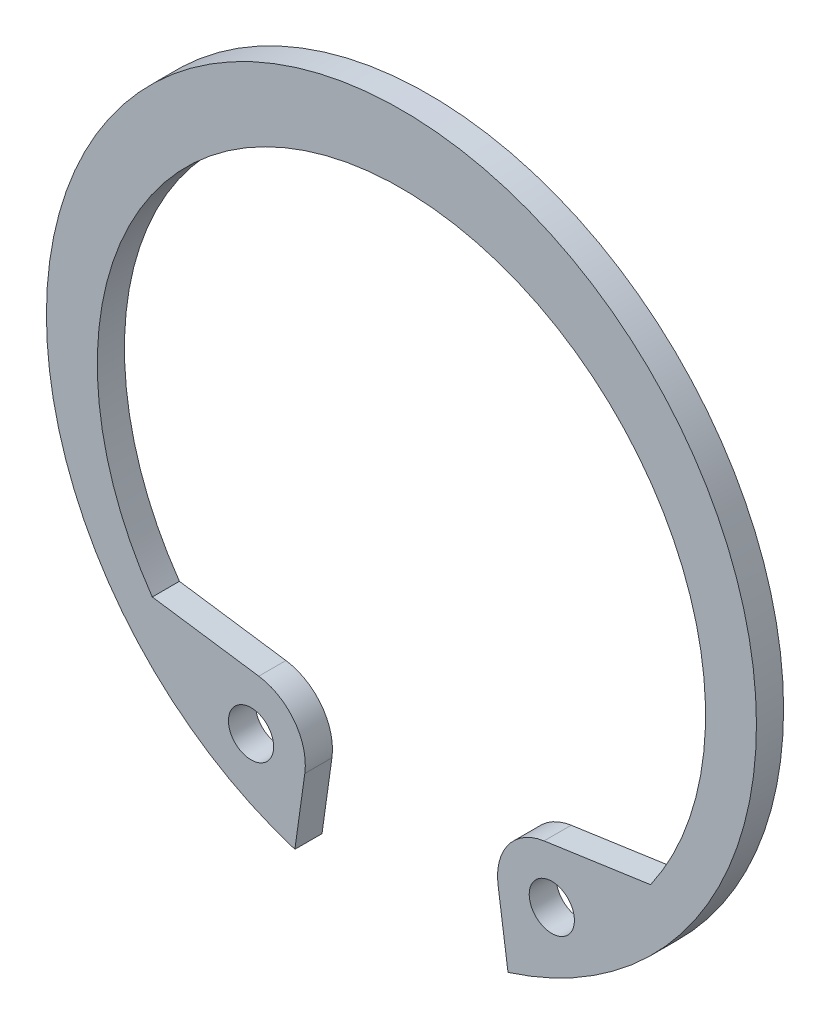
ISO-10303-21;
HEADER;
FILE_DESCRIPTION(('STEP AP214'),'2;1');
FILE_NAME('part.step','',(''),(''),'','','');
FILE_SCHEMA(('AUTOMOTIVE_DESIGN { 1 0 10303 214 1 1 1 1 }'));
ENDSEC;
DATA;
#1=APPLICATION_CONTEXT('core data for automotive mechanical design processes');
#2=APPLICATION_PROTOCOL_DEFINITION('international standard','automotive_design',2000,#1);
#3=PRODUCT_CONTEXT('',#1,'mechanical');
#4=PRODUCT('Part','Part','',(#3));
#5=PRODUCT_RELATED_PRODUCT_CATEGORY('part','',(#4));
#6=PRODUCT_DEFINITION_FORMATION('','',#4);
#7=PRODUCT_DEFINITION_CONTEXT('part definition',#1,'design');
#8=PRODUCT_DEFINITION('design','',#6,#7);
#9=PRODUCT_DEFINITION_SHAPE('','',#8);
#10=(LENGTH_UNIT() NAMED_UNIT(*) SI_UNIT(.MILLI.,.METRE.));
#11=(NAMED_UNIT(*) PLANE_ANGLE_UNIT() SI_UNIT($,.RADIAN.));
#12=(NAMED_UNIT(*) SI_UNIT($,.STERADIAN.) SOLID_ANGLE_UNIT());
#13=UNCERTAINTY_MEASURE_WITH_UNIT(LENGTH_MEASURE(1.E-05),#10,'distance_accuracy_value','');
#14=(GEOMETRIC_REPRESENTATION_CONTEXT(3) GLOBAL_UNCERTAINTY_ASSIGNED_CONTEXT((#13)) GLOBAL_UNIT_ASSIGNED_CONTEXT((#10,
#11,#12)) REPRESENTATION_CONTEXT('',''));
#15=CARTESIAN_POINT('',(0.,0.,0.));
#16=DIRECTION('',(0.,0.,1.));
#17=DIRECTION('',(1.,0.,0.));
#18=AXIS2_PLACEMENT_3D('',#15,#16,#17);
#19=CARTESIAN_POINT('',(-6.30800469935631,-9.14262966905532,1.2));
#20=DIRECTION('',(-0.142498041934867,-0.98979508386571,0.));
#21=DIRECTION('',(0.989795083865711,-0.142498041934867,0.));
#22=AXIS2_PLACEMENT_3D('',#19,#20,#21);
#23=PLANE('',#22);
#24=DIRECTION('',(-0.98979508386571,0.142498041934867,0.));
#25=VECTOR('',#24,1.);
#26=CARTESIAN_POINT('',(-6.30800469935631,-9.14262966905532,0.));
#27=LINE('',#26,#25);
#28=CARTESIAN_POINT('',(-6.30800469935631,-9.14262966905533,0.));
#29=VERTEX_POINT('',#28);
#30=CARTESIAN_POINT('',(-11.0175949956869,-8.46460306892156,0.));
#31=VERTEX_POINT('',#30);
#32=EDGE_CURVE('E93',#29,#31,#27,.T.);
#33=ORIENTED_EDGE('',*,*,#32,.T.);
#34=DIRECTION('',(0.,0.,-1.));
#35=VECTOR('',#34,1.);
#36=CARTESIAN_POINT('',(-11.0175949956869,-8.46460306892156,1.2));
#37=LINE('',#36,#35);
#38=CARTESIAN_POINT('',(-11.0175949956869,-8.46460306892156,1.2));
#39=VERTEX_POINT('',#38);
#40=EDGE_CURVE('E9',#39,#31,#37,.T.);
#41=ORIENTED_EDGE('',*,*,#40,.F.);
#42=DIRECTION('',(-0.98979508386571,0.142498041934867,0.));
#43=VECTOR('',#42,1.);
#44=CARTESIAN_POINT('',(-6.30800469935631,-9.14262966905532,1.2));
#45=LINE('',#44,#43);
#46=CARTESIAN_POINT('',(-6.30800469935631,-9.14262966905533,1.2));
#47=VERTEX_POINT('',#46);
#48=EDGE_CURVE('E113',#47,#39,#45,.T.);
#49=ORIENTED_EDGE('',*,*,#48,.F.);
#50=DIRECTION('',(0.,0.,-1.));
#51=VECTOR('',#50,1.);
#52=CARTESIAN_POINT('',(-6.30800469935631,-9.14262966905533,1.2));
#53=LINE('',#52,#51);
#54=EDGE_CURVE('E128',#47,#29,#53,.T.);
#55=ORIENTED_EDGE('',*,*,#54,.T.);
#56=EDGE_LOOP('',(#33,#41,#49,#55));
#57=FACE_BOUND('',#56,.T.);
#58=ADVANCED_FACE('F12',(#57),#23,.F.);
#59=CARTESIAN_POINT('',(0.,-0.75,1.2));
#60=DIRECTION('',(0.,0.,-1.));
#61=DIRECTION('',(-1.,0.,0.));
#62=AXIS2_PLACEMENT_3D('',#59,#60,#61);
#63=CYLINDRICAL_SURFACE('',#62,13.45);
#64=CARTESIAN_POINT('',(0.,-0.75,0.));
#65=DIRECTION('',(0.,0.,1.));
#66=DIRECTION('',(1.,0.,0.));
#67=AXIS2_PLACEMENT_3D('',#64,#65,#66);
#68=CIRCLE('',#67,13.45);
#69=CARTESIAN_POINT('',(11.0175949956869,-8.46460306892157,0.));
#70=VERTEX_POINT('',#69);
#71=EDGE_CURVE('E87',#70,#31,#68,.T.);
#72=ORIENTED_EDGE('',*,*,#71,.F.);
#73=DIRECTION('',(0.,0.,-1.));
#74=VECTOR('',#73,1.);
#75=CARTESIAN_POINT('',(11.0175949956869,-8.46460306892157,1.2));
#76=LINE('',#75,#74);
#77=CARTESIAN_POINT('',(11.0175949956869,-8.46460306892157,1.2));
#78=VERTEX_POINT('',#77);
#79=EDGE_CURVE('E15',#78,#70,#76,.T.);
#80=ORIENTED_EDGE('',*,*,#79,.F.);
#81=CARTESIAN_POINT('',(0.,-0.75,1.2));
#82=DIRECTION('',(0.,0.,1.));
#83=DIRECTION('',(1.,0.,0.));
#84=AXIS2_PLACEMENT_3D('',#81,#82,#83);
#85=CIRCLE('',#84,13.45);
#86=EDGE_CURVE('E116',#78,#39,#85,.T.);
#87=ORIENTED_EDGE('',*,*,#86,.T.);
#88=ORIENTED_EDGE('',*,*,#40,.T.);
#89=EDGE_LOOP('',(#72,#80,#87,#88));
#90=FACE_BOUND('',#89,.T.);
#91=ADVANCED_FACE('F88',(#90),#63,.F.);
#92=CARTESIAN_POINT('',(6.30800469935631,-9.14262966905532,1.2));
#93=DIRECTION('',(-0.142498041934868,0.98979508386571,0.));
#94=DIRECTION('',(-0.98979508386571,-0.142498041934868,0.));
#95=AXIS2_PLACEMENT_3D('',#92,#93,#94);
#96=PLANE('',#95);
#97=DIRECTION('',(0.98979508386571,0.142498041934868,0.));
#98=VECTOR('',#97,1.);
#99=CARTESIAN_POINT('',(6.30800469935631,-9.14262966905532,0.));
#100=LINE('',#99,#98);
#101=CARTESIAN_POINT('',(6.30800469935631,-9.14262966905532,0.));
#102=VERTEX_POINT('',#101);
#103=EDGE_CURVE('E79',#102,#70,#100,.T.);
#104=ORIENTED_EDGE('',*,*,#103,.F.);
#105=DIRECTION('',(0.,0.,-1.));
#106=VECTOR('',#105,1.);
#107=CARTESIAN_POINT('',(6.30800469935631,-9.14262966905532,1.2));
#108=LINE('',#107,#106);
#109=CARTESIAN_POINT('',(6.30800469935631,-9.14262966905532,1.2));
#110=VERTEX_POINT('',#109);
#111=EDGE_CURVE('E85',#110,#102,#108,.T.);
#112=ORIENTED_EDGE('',*,*,#111,.F.);
#113=DIRECTION('',(0.98979508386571,0.142498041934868,0.));
#114=VECTOR('',#113,1.);
#115=CARTESIAN_POINT('',(6.30800469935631,-9.14262966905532,1.2));
#116=LINE('',#115,#114);
#117=EDGE_CURVE('E81',#110,#78,#116,.T.);
#118=ORIENTED_EDGE('',*,*,#117,.T.);
#119=ORIENTED_EDGE('',*,*,#79,.T.);
#120=EDGE_LOOP('',(#104,#112,#118,#119));
#121=FACE_BOUND('',#120,.T.);
#122=ADVANCED_FACE('F77',(#121),#96,.T.);
#123=CARTESIAN_POINT('',(6.65,-11.518137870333,1.2));
#124=DIRECTION('',(0.,0.,-1.));
#125=DIRECTION('',(-1.,0.,0.));
#126=AXIS2_PLACEMENT_3D('',#123,#124,#125);
#127=CYLINDRICAL_SURFACE('',#126,2.4);
#128=CARTESIAN_POINT('',(6.65,-11.518137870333,0.));
#129=DIRECTION('',(0.,0.,1.));
#130=DIRECTION('',(1.,0.,0.));
#131=AXIS2_PLACEMENT_3D('',#128,#129,#130);
#132=CIRCLE('',#131,2.4);
#133=CARTESIAN_POINT('',(4.27335663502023,-11.8521533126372,0.));
#134=VERTEX_POINT('',#133);
#135=EDGE_CURVE('E98',#102,#134,#132,.T.);
#136=ORIENTED_EDGE('',*,*,#135,.T.);
#137=DIRECTION('',(0.,0.,-1.));
#138=VECTOR('',#137,1.);
#139=CARTESIAN_POINT('',(4.27335663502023,-11.8521533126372,1.2));
#140=LINE('',#139,#138);
#141=CARTESIAN_POINT('',(4.27335663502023,-11.8521533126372,1.2));
#142=VERTEX_POINT('',#141);
#143=EDGE_CURVE('E138',#142,#134,#140,.T.);
#144=ORIENTED_EDGE('',*,*,#143,.F.);
#145=CARTESIAN_POINT('',(6.65,-11.518137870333,1.2));
#146=DIRECTION('',(0.,0.,1.));
#147=DIRECTION('',(1.,0.,0.));
#148=AXIS2_PLACEMENT_3D('',#145,#146,#147);
#149=CIRCLE('',#148,2.4);
#150=EDGE_CURVE('E119',#110,#142,#149,.T.);
#151=ORIENTED_EDGE('',*,*,#150,.F.);
#152=ORIENTED_EDGE('',*,*,#111,.T.);
#153=EDGE_LOOP('',(#136,#144,#151,#152));
#154=FACE_BOUND('',#153,.T.);
#155=ADVANCED_FACE('F143',(#154),#127,.T.);
#156=CARTESIAN_POINT('',(4.27335663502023,-11.8521533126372,1.2));
#157=DIRECTION('',(0.990268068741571,0.139173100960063,0.));
#158=DIRECTION('',(-0.139173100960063,0.990268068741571,0.));
#159=AXIS2_PLACEMENT_3D('',#156,#157,#158);
#160=PLANE('',#159);
#161=DIRECTION('',(0.139173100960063,-0.990268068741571,0.));
#162=VECTOR('',#161,1.);
#163=CARTESIAN_POINT('',(4.27335663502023,-11.8521533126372,0.));
#164=LINE('',#163,#162);
#165=CARTESIAN_POINT('',(4.71239748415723,-14.9760912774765,0.));
#166=VERTEX_POINT('',#165);
#167=EDGE_CURVE('E100',#134,#166,#164,.T.);
#168=ORIENTED_EDGE('',*,*,#167,.T.);
#169=DIRECTION('',(0.,0.,-1.));
#170=VECTOR('',#169,1.);
#171=CARTESIAN_POINT('',(4.71239748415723,-14.9760912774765,1.2));
#172=LINE('',#171,#170);
#173=CARTESIAN_POINT('',(4.71239748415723,-14.9760912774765,1.2));
#174=VERTEX_POINT('',#173);
#175=EDGE_CURVE('E135',#174,#166,#172,.T.);
#176=ORIENTED_EDGE('',*,*,#175,.F.);
#177=DIRECTION('',(0.139173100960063,-0.990268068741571,0.));
#178=VECTOR('',#177,1.);
#179=CARTESIAN_POINT('',(4.27335663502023,-11.8521533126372,1.2));
#180=LINE('',#179,#178);
#181=EDGE_CURVE('E121',#142,#174,#180,.T.);
#182=ORIENTED_EDGE('',*,*,#181,.F.);
#183=ORIENTED_EDGE('',*,*,#143,.T.);
#184=EDGE_LOOP('',(#168,#176,#182,#183));
#185=FACE_BOUND('',#184,.T.);
#186=ADVANCED_FACE('F159',(#185),#160,.F.);
#187=CARTESIAN_POINT('',(0.,0.,1.2));
#188=DIRECTION('',(0.,0.,-1.));
#189=DIRECTION('',(-1.,0.,0.));
#190=AXIS2_PLACEMENT_3D('',#187,#188,#189);
#191=CYLINDRICAL_SURFACE('',#190,15.7);
#192=CARTESIAN_POINT('',(0.,0.,0.));
#193=DIRECTION('',(0.,0.,1.));
#194=DIRECTION('',(1.,0.,0.));
#195=AXIS2_PLACEMENT_3D('',#192,#193,#194);
#196=CIRCLE('',#195,15.7);
#197=CARTESIAN_POINT('',(-4.71239748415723,-14.9760912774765,0.));
#198=VERTEX_POINT('',#197);
#199=EDGE_CURVE('E105',#166,#198,#196,.T.);
#200=ORIENTED_EDGE('',*,*,#199,.T.);
#201=DIRECTION('',(0.,0.,-1.));
#202=VECTOR('',#201,1.);
#203=CARTESIAN_POINT('',(-4.71239748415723,-14.9760912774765,1.2));
#204=LINE('',#203,#202);
#205=CARTESIAN_POINT('',(-4.71239748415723,-14.9760912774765,1.2));
#206=VERTEX_POINT('',#205);
#207=EDGE_CURVE('E133',#206,#198,#204,.T.);
#208=ORIENTED_EDGE('',*,*,#207,.F.);
#209=CARTESIAN_POINT('',(0.,0.,1.2));
#210=DIRECTION('',(0.,0.,1.));
#211=DIRECTION('',(1.,0.,0.));
#212=AXIS2_PLACEMENT_3D('',#209,#210,#211);
#213=CIRCLE('',#212,15.7);
#214=EDGE_CURVE('E123',#174,#206,#213,.T.);
#215=ORIENTED_EDGE('',*,*,#214,.F.);
#216=ORIENTED_EDGE('',*,*,#175,.T.);
#217=EDGE_LOOP('',(#200,#208,#215,#216));
#218=FACE_BOUND('',#217,.T.);
#219=ADVANCED_FACE('F156',(#218),#191,.T.);
#220=CARTESIAN_POINT('',(-4.27335663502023,-11.8521533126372,1.2));
#221=DIRECTION('',(0.99026806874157,-0.139173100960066,0.));
#222=DIRECTION('',(0.139173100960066,0.99026806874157,0.));
#223=AXIS2_PLACEMENT_3D('',#220,#221,#222);
#224=PLANE('',#223);
#225=DIRECTION('',(-0.139173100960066,-0.99026806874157,0.));
#226=VECTOR('',#225,1.);
#227=CARTESIAN_POINT('',(-4.27335663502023,-11.8521533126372,0.));
#228=LINE('',#227,#226);
#229=CARTESIAN_POINT('',(-4.27335663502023,-11.8521533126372,0.));
#230=VERTEX_POINT('',#229);
#231=EDGE_CURVE('E108',#230,#198,#228,.T.);
#232=ORIENTED_EDGE('',*,*,#231,.F.);
#233=DIRECTION('',(0.,0.,-1.));
#234=VECTOR('',#233,1.);
#235=CARTESIAN_POINT('',(-4.27335663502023,-11.8521533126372,1.2));
#236=LINE('',#235,#234);
#237=CARTESIAN_POINT('',(-4.27335663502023,-11.8521533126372,1.2));
#238=VERTEX_POINT('',#237);
#239=EDGE_CURVE('E34',#238,#230,#236,.T.);
#240=ORIENTED_EDGE('',*,*,#239,.F.);
#241=DIRECTION('',(-0.139173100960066,-0.99026806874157,0.));
#242=VECTOR('',#241,1.);
#243=CARTESIAN_POINT('',(-4.27335663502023,-11.8521533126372,1.2));
#244=LINE('',#243,#242);
#245=EDGE_CURVE('E125',#238,#206,#244,.T.);
#246=ORIENTED_EDGE('',*,*,#245,.T.);
#247=ORIENTED_EDGE('',*,*,#207,.T.);
#248=EDGE_LOOP('',(#232,#240,#246,#247));
#249=FACE_BOUND('',#248,.T.);
#250=ADVANCED_FACE('F152',(#249),#224,.T.);
#251=CARTESIAN_POINT('',(-6.65,-11.518137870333,1.2));
#252=DIRECTION('',(0.,0.,-1.));
#253=DIRECTION('',(-1.,0.,0.));
#254=AXIS2_PLACEMENT_3D('',#251,#252,#253);
#255=CYLINDRICAL_SURFACE('',#254,2.4);
#256=CARTESIAN_POINT('',(-6.65,-11.518137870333,0.));
#257=DIRECTION('',(0.,0.,1.));
#258=DIRECTION('',(1.,0.,0.));
#259=AXIS2_PLACEMENT_3D('',#256,#257,#258);
#260=CIRCLE('',#259,2.4);
#261=EDGE_CURVE('E111',#230,#29,#260,.T.);
#262=ORIENTED_EDGE('',*,*,#261,.T.);
#263=ORIENTED_EDGE('',*,*,#54,.F.);
#264=CARTESIAN_POINT('',(-6.65,-11.518137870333,1.2));
#265=DIRECTION('',(0.,0.,1.));
#266=DIRECTION('',(1.,0.,0.));
#267=AXIS2_PLACEMENT_3D('',#264,#265,#266);
#268=CIRCLE('',#267,2.4);
#269=EDGE_CURVE('E26',#238,#47,#268,.T.);
#270=ORIENTED_EDGE('',*,*,#269,.F.);
#271=ORIENTED_EDGE('',*,*,#239,.T.);
#272=EDGE_LOOP('',(#262,#263,#270,#271));
#273=FACE_BOUND('',#272,.T.);
#274=ADVANCED_FACE('F180',(#273),#255,.T.);
#275=CARTESIAN_POINT('',(0.,-0.75,1.2));
#276=DIRECTION('',(0.,0.,1.));
#277=DIRECTION('',(1.,0.,0.));
#278=AXIS2_PLACEMENT_3D('',#275,#276,#277);
#279=PLANE('',#278);
#280=CARTESIAN_POINT('',(6.65,-11.518137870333,1.2));
#281=DIRECTION('',(0.,0.,-1.));
#282=DIRECTION('',(0.,1.,0.));
#283=AXIS2_PLACEMENT_3D('',#280,#281,#282);
#284=CIRCLE('',#283,1.);
#285=CARTESIAN_POINT('',(6.65,-10.518137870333,1.2));
#286=VERTEX_POINT('',#285);
#287=EDGE_CURVE('E205',#286,#286,#284,.T.);
#288=ORIENTED_EDGE('',*,*,#287,.T.);
#289=EDGE_LOOP('',(#288));
#290=FACE_BOUND('',#289,.T.);
#291=CARTESIAN_POINT('',(-6.65,-11.518137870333,1.2));
#292=DIRECTION('',(0.,0.,-1.));
#293=DIRECTION('',(0.,1.,0.));
#294=AXIS2_PLACEMENT_3D('',#291,#292,#293);
#295=CIRCLE('',#294,1.);
#296=CARTESIAN_POINT('',(-6.65,-10.518137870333,1.2));
#297=VERTEX_POINT('',#296);
#298=EDGE_CURVE('E115',#297,#297,#295,.T.);
#299=ORIENTED_EDGE('',*,*,#298,.T.);
#300=EDGE_LOOP('',(#299));
#301=FACE_BOUND('',#300,.T.);
#302=ORIENTED_EDGE('',*,*,#48,.T.);
#303=ORIENTED_EDGE('',*,*,#86,.F.);
#304=ORIENTED_EDGE('',*,*,#117,.F.);
#305=ORIENTED_EDGE('',*,*,#150,.T.);
#306=ORIENTED_EDGE('',*,*,#181,.T.);
#307=ORIENTED_EDGE('',*,*,#214,.T.);
#308=ORIENTED_EDGE('',*,*,#245,.F.);
#309=ORIENTED_EDGE('',*,*,#269,.T.);
#310=EDGE_LOOP('',(#302,#303,#304,#305,#306,#307,#308,#309));
#311=FACE_BOUND('',#310,.T.);
#312=ADVANCED_FACE('F146',(#290,#301,#311),#279,.T.);
#313=CARTESIAN_POINT('',(0.,-0.75,0.));
#314=DIRECTION('',(0.,0.,1.));
#315=DIRECTION('',(1.,0.,0.));
#316=AXIS2_PLACEMENT_3D('',#313,#314,#315);
#317=PLANE('',#316);
#318=CARTESIAN_POINT('',(6.65,-11.518137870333,0.));
#319=DIRECTION('',(0.,0.,1.));
#320=DIRECTION('',(0.,1.,0.));
#321=AXIS2_PLACEMENT_3D('',#318,#319,#320);
#322=CIRCLE('',#321,1.);
#323=CARTESIAN_POINT('',(6.65,-10.518137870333,0.));
#324=VERTEX_POINT('',#323);
#325=EDGE_CURVE('E208',#324,#324,#322,.T.);
#326=ORIENTED_EDGE('',*,*,#325,.T.);
#327=EDGE_LOOP('',(#326));
#328=FACE_BOUND('',#327,.T.);
#329=CARTESIAN_POINT('',(-6.65,-11.518137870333,0.));
#330=DIRECTION('',(0.,0.,1.));
#331=DIRECTION('',(0.,1.,0.));
#332=AXIS2_PLACEMENT_3D('',#329,#330,#331);
#333=CIRCLE('',#332,1.);
#334=CARTESIAN_POINT('',(-6.65,-10.518137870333,0.));
#335=VERTEX_POINT('',#334);
#336=EDGE_CURVE('E210',#335,#335,#333,.T.);
#337=ORIENTED_EDGE('',*,*,#336,.T.);
#338=EDGE_LOOP('',(#337));
#339=FACE_BOUND('',#338,.T.);
#340=ORIENTED_EDGE('',*,*,#32,.F.);
#341=ORIENTED_EDGE('',*,*,#261,.F.);
#342=ORIENTED_EDGE('',*,*,#231,.T.);
#343=ORIENTED_EDGE('',*,*,#199,.F.);
#344=ORIENTED_EDGE('',*,*,#167,.F.);
#345=ORIENTED_EDGE('',*,*,#135,.F.);
#346=ORIENTED_EDGE('',*,*,#103,.T.);
#347=ORIENTED_EDGE('',*,*,#71,.T.);
#348=EDGE_LOOP('',(#340,#341,#342,#343,#344,#345,#346,#347));
#349=FACE_BOUND('',#348,.T.);
#350=ADVANCED_FACE('F96',(#328,#339,#349),#317,.F.);
#351=CARTESIAN_POINT('',(-6.65,-11.518137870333,0.));
#352=DIRECTION('',(0.,0.,1.));
#353=DIRECTION('',(0.,1.,0.));
#354=AXIS2_PLACEMENT_3D('',#351,#352,#353);
#355=CYLINDRICAL_SURFACE('',#354,1.);
#356=ORIENTED_EDGE('',*,*,#298,.F.);
#357=EDGE_LOOP('',(#356));
#358=FACE_BOUND('',#357,.T.);
#359=ORIENTED_EDGE('',*,*,#336,.F.);
#360=EDGE_LOOP('',(#359));
#361=FACE_BOUND('',#360,.T.);
#362=ADVANCED_FACE('F191',(#358,#361),#355,.F.);
#363=CARTESIAN_POINT('',(6.65,-11.518137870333,0.));
#364=DIRECTION('',(0.,0.,1.));
#365=DIRECTION('',(0.,1.,0.));
#366=AXIS2_PLACEMENT_3D('',#363,#364,#365);
#367=CYLINDRICAL_SURFACE('',#366,1.);
#368=ORIENTED_EDGE('',*,*,#287,.F.);
#369=EDGE_LOOP('',(#368));
#370=FACE_BOUND('',#369,.T.);
#371=ORIENTED_EDGE('',*,*,#325,.F.);
#372=EDGE_LOOP('',(#371));
#373=FACE_BOUND('',#372,.T.);
#374=ADVANCED_FACE('F196',(#370,#373),#367,.F.);
#375=CLOSED_SHELL('',(#58,#91,#122,#155,#186,#219,#250,#274,#312,#350,#362,#374));
#376=MANIFOLD_SOLID_BREP('B1',#375);
#377=ADVANCED_BREP_SHAPE_REPRESENTATION('',(#18,#376),#14);
#378=SHAPE_DEFINITION_REPRESENTATION(#9,#377);
ENDSEC;
END-ISO-10303-21;
